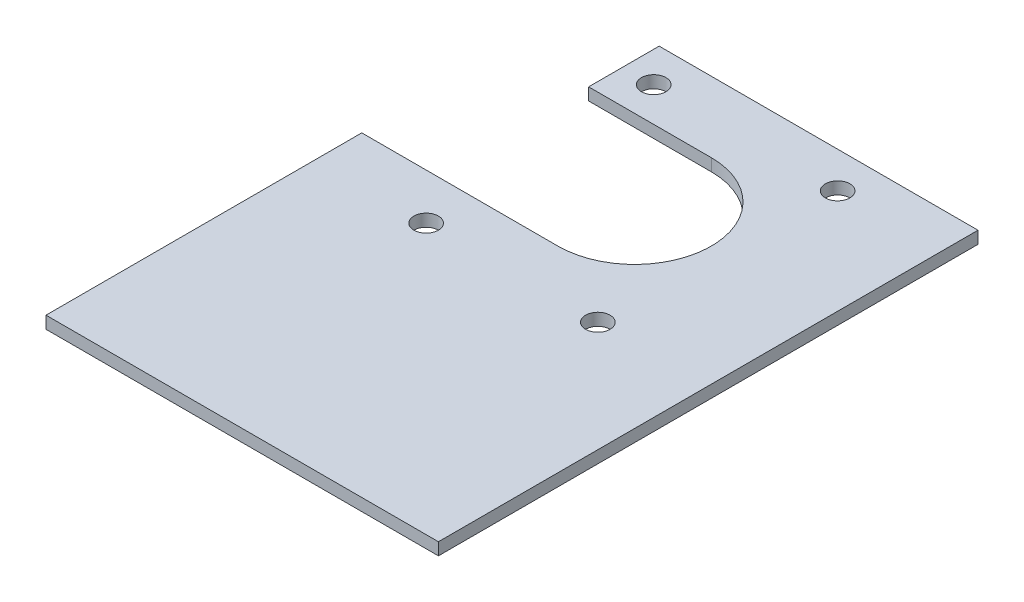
from build123d import *

# Parameters (mm, degrees)
BOSS_EXTRUDE1_DEPTH = 1.5875
SKETCH5_R           = 1.5875
CUT_EXTRUDE2_DEPTH  = 57.818308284


with BuildPart() as part:
    # Sketch1 → Boss-Extrude1 (new body)
    with BuildSketch(Plane(origin=(0, 0, 0), x_dir=(1, 0, 0), z_dir=(0, 1, 0))):
        with BuildLine():
            Line((25.4, 19.05), (-15.875, 19.05))
            Line((-15.875, 19.05), (-15.875, 9.921875))
            Line((-15.875, 9.921875), (0, 9.921875))
            ThreePointArc((0, 9.921875), (7.015825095, 7.015825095), (9.921875, 0))
            ThreePointArc((9.921875, 0), (7.015825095, -7.015825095), (0, -9.921875))
            Line((0, -9.921875), (-25.4, -9.921875))
            Line((-25.4, -9.921875), (-25.4, -50.8))
            Line((-25.4, -50.8), (25.4, -50.8))
            Line((25.4, -50.8), (25.4, 19.05))
        make_face()
    extrude(amount=BOSS_EXTRUDE1_DEPTH)

    # Sketch5 → Cut-Extrude2 (cut, through all)
    with BuildSketch(Plane(origin=(0, 1.5875, 0), x_dir=(1, 0, 0), z_dir=(0, 1, 0))):
        with Locations(Location((11.90625, 14.3764, 0), (0, 0, 270))):
            Circle(SKETCH5_R)
        with Locations(Location((-11.90625, 14.3764, 0), (0, 0, 270))):
            Circle(SKETCH5_R)
        with Locations(Location((11.1125, -15.875, 0), (0, 0, 270))):
            Circle(SKETCH5_R)
        with Locations(Location((-11.1125, -15.875, 0), (0, 0, 270))):
            Circle(SKETCH5_R)
    extrude(amount=-CUT_EXTRUDE2_DEPTH, mode=Mode.SUBTRACT)


solid = part.part
